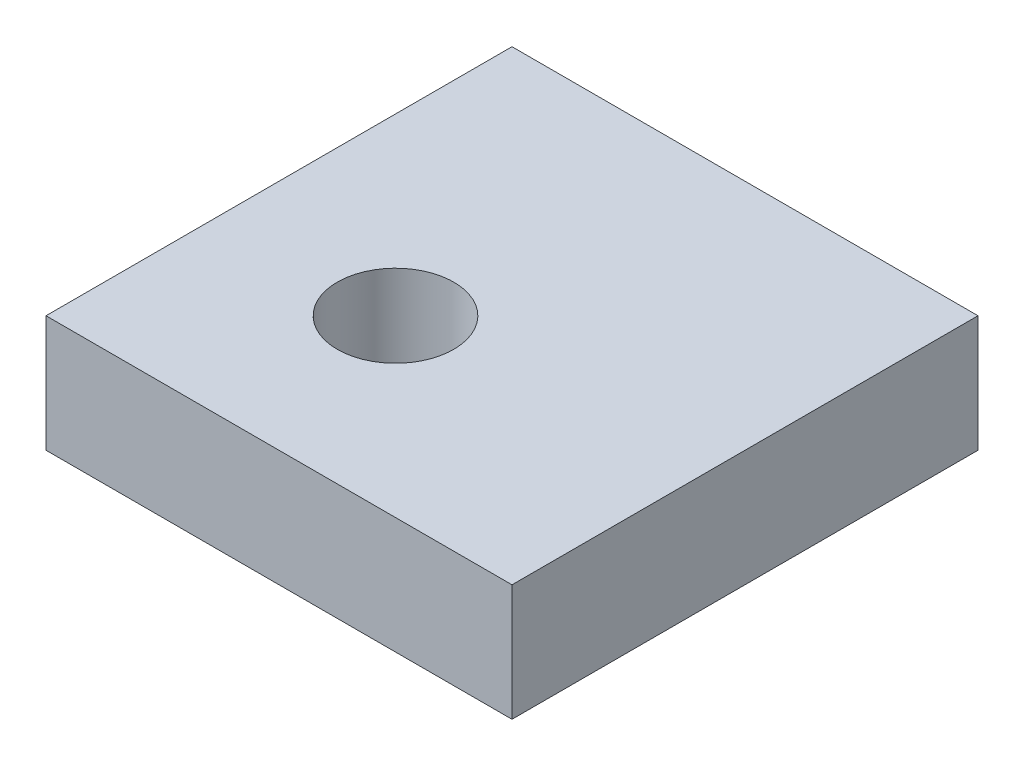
from build123d import *

# Parameters (mm, degrees)
SKETCH1_W           = 12.7
SKETCH1_H           = 12.7
BOSS_EXTRUDE1_DEPTH = 3.175
SKETCH2_R           = 1.5875
CUT_EXTRUDE1_DEPTH  = 10.525


with BuildPart() as part:
    # Sketch1 → Boss-Extrude1 (new body)
    with BuildSketch(Plane(origin=(0, 0, 0), x_dir=(1, 0, 0), z_dir=(0, 1, 0))):
        Rectangle(SKETCH1_W, SKETCH1_H)
    extrude(amount=BOSS_EXTRUDE1_DEPTH)

    # Sketch2 → Cut-Extrude1 (cut, through all)
    with BuildSketch(Plane(origin=(0, 3.175, 0), x_dir=(1, 0, 0), z_dir=(0, 1, 0))):
        with Locations(Location((-1.5875, -1.5875, 0), (0, 0, 270))):
            Circle(SKETCH2_R)
    extrude(amount=-CUT_EXTRUDE1_DEPTH, mode=Mode.SUBTRACT)


solid = part.part
